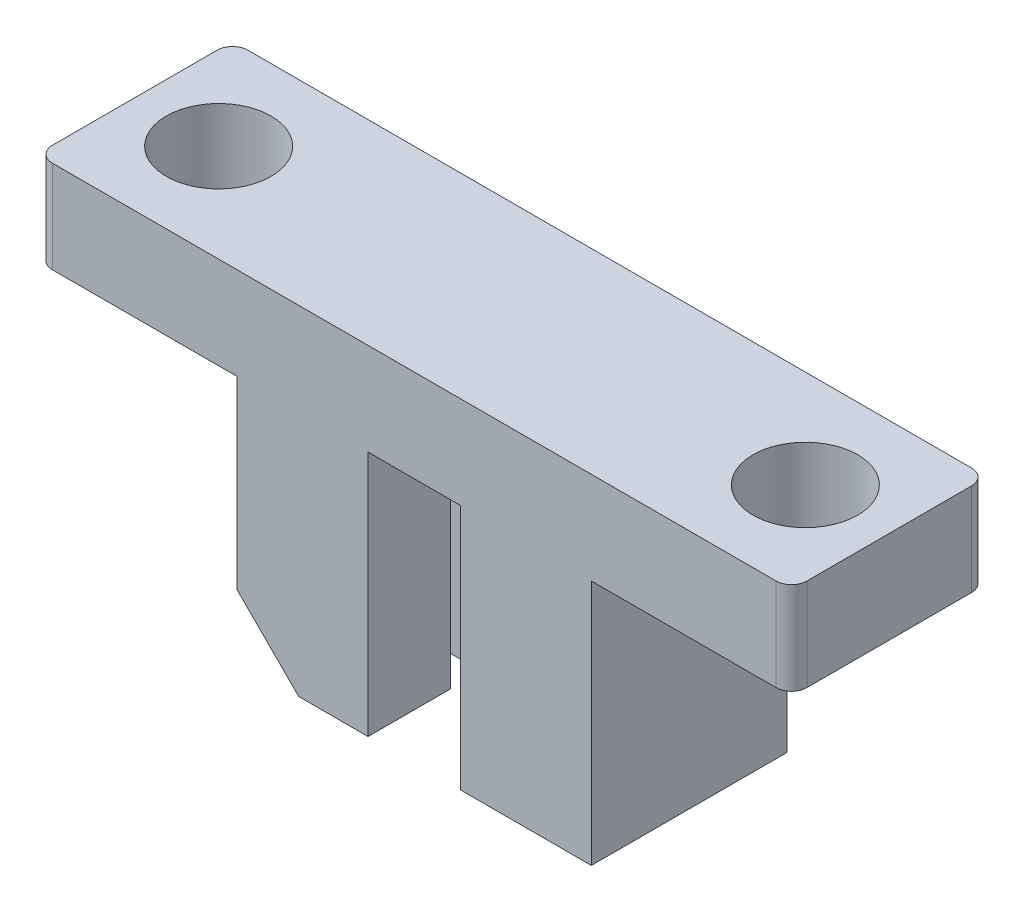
ISO-10303-21;
HEADER;
FILE_DESCRIPTION(('STEP AP214'),'2;1');
FILE_NAME('part.step','',(''),(''),'','','');
FILE_SCHEMA(('AUTOMOTIVE_DESIGN { 1 0 10303 214 1 1 1 1 }'));
ENDSEC;
DATA;
#1=APPLICATION_CONTEXT('core data for automotive mechanical design processes');
#2=APPLICATION_PROTOCOL_DEFINITION('international standard','automotive_design',2000,#1);
#3=PRODUCT_CONTEXT('',#1,'mechanical');
#4=PRODUCT('Part','Part','',(#3));
#5=PRODUCT_RELATED_PRODUCT_CATEGORY('part','',(#4));
#6=PRODUCT_DEFINITION_FORMATION('','',#4);
#7=PRODUCT_DEFINITION_CONTEXT('part definition',#1,'design');
#8=PRODUCT_DEFINITION('design','',#6,#7);
#9=PRODUCT_DEFINITION_SHAPE('','',#8);
#10=(LENGTH_UNIT() NAMED_UNIT(*) SI_UNIT(.MILLI.,.METRE.));
#11=(NAMED_UNIT(*) PLANE_ANGLE_UNIT() SI_UNIT($,.RADIAN.));
#12=(NAMED_UNIT(*) SI_UNIT($,.STERADIAN.) SOLID_ANGLE_UNIT());
#13=UNCERTAINTY_MEASURE_WITH_UNIT(LENGTH_MEASURE(1.E-05),#10,'distance_accuracy_value','');
#14=(GEOMETRIC_REPRESENTATION_CONTEXT(3) GLOBAL_UNCERTAINTY_ASSIGNED_CONTEXT((#13)) GLOBAL_UNIT_ASSIGNED_CONTEXT((#10,
#11,#12)) REPRESENTATION_CONTEXT('',''));
#15=CARTESIAN_POINT('',(0.,0.,0.));
#16=DIRECTION('',(0.,0.,1.));
#17=DIRECTION('',(1.,0.,0.));
#18=AXIS2_PLACEMENT_3D('',#15,#16,#17);
#19=CARTESIAN_POINT('',(-12.25,-3.,3.175));
#20=DIRECTION('',(1.,0.,0.));
#21=DIRECTION('',(0.,1.,0.));
#22=AXIS2_PLACEMENT_3D('',#19,#20,#21);
#23=PLANE('',#22);
#24=DIRECTION('',(0.,0.,-1.));
#25=VECTOR('',#24,1.);
#26=CARTESIAN_POINT('',(-12.25,-3.,3.175));
#27=LINE('',#26,#25);
#28=CARTESIAN_POINT('',(-12.25,-3.,2.675));
#29=VERTEX_POINT('',#28);
#30=CARTESIAN_POINT('',(-12.25,-3.,-2.675));
#31=VERTEX_POINT('',#30);
#32=EDGE_CURVE('E349',#29,#31,#27,.T.);
#33=ORIENTED_EDGE('',*,*,#32,.F.);
#34=DIRECTION('',(0.,-1.,0.));
#35=VECTOR('',#34,1.);
#36=CARTESIAN_POINT('',(-12.25,-3.,2.675));
#37=LINE('',#36,#35);
#38=CARTESIAN_POINT('',(-12.25,0.,2.675));
#39=VERTEX_POINT('',#38);
#40=EDGE_CURVE('E370',#29,#39,#37,.F.);
#41=ORIENTED_EDGE('',*,*,#40,.T.);
#42=DIRECTION('',(0.,0.,-1.));
#43=VECTOR('',#42,1.);
#44=CARTESIAN_POINT('',(-12.25,0.,3.175));
#45=LINE('',#44,#43);
#46=CARTESIAN_POINT('',(-12.25,0.,-2.675));
#47=VERTEX_POINT('',#46);
#48=EDGE_CURVE('E289',#39,#47,#45,.T.);
#49=ORIENTED_EDGE('',*,*,#48,.T.);
#50=DIRECTION('',(0.,-1.,0.));
#51=VECTOR('',#50,1.);
#52=CARTESIAN_POINT('',(-12.25,-3.,-2.675));
#53=LINE('',#52,#51);
#54=EDGE_CURVE('E367',#47,#31,#53,.T.);
#55=ORIENTED_EDGE('',*,*,#54,.T.);
#56=EDGE_LOOP('',(#33,#41,#49,#55));
#57=FACE_BOUND('',#56,.T.);
#58=ADVANCED_FACE('F32',(#57),#23,.F.);
#59=CARTESIAN_POINT('',(-5.75,-3.,3.175));
#60=DIRECTION('',(0.,1.,0.));
#61=DIRECTION('',(-1.,0.,0.));
#62=AXIS2_PLACEMENT_3D('',#59,#60,#61);
#63=PLANE('',#62);
#64=CARTESIAN_POINT('',(-9.525,-3.,0.));
#65=DIRECTION('',(0.,-1.,0.));
#66=DIRECTION('',(0.,0.,-1.));
#67=AXIS2_PLACEMENT_3D('',#64,#65,#66);
#68=CIRCLE('',#67,1.69999999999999);
#69=CARTESIAN_POINT('',(-9.525,-3.,-1.69999999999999));
#70=VERTEX_POINT('',#69);
#71=EDGE_CURVE('E725',#70,#70,#68,.T.);
#72=ORIENTED_EDGE('',*,*,#71,.F.);
#73=EDGE_LOOP('',(#72));
#74=FACE_BOUND('',#73,.T.);
#75=DIRECTION('',(1.,0.,0.));
#76=VECTOR('',#75,1.);
#77=CARTESIAN_POINT('',(-5.75,-3.,3.175));
#78=LINE('',#77,#76);
#79=CARTESIAN_POINT('',(-11.75,-3.,3.175));
#80=VERTEX_POINT('',#79);
#81=CARTESIAN_POINT('',(-5.75,-3.,3.175));
#82=VERTEX_POINT('',#81);
#83=EDGE_CURVE('E264',#80,#82,#78,.T.);
#84=ORIENTED_EDGE('',*,*,#83,.F.);
#85=CARTESIAN_POINT('',(-11.75,-3.,2.675));
#86=DIRECTION('',(0.,1.,0.));
#87=DIRECTION('',(-1.,0.,0.));
#88=AXIS2_PLACEMENT_3D('',#85,#86,#87);
#89=CIRCLE('',#88,0.5);
#90=EDGE_CURVE('E365',#80,#29,#89,.F.);
#91=ORIENTED_EDGE('',*,*,#90,.T.);
#92=ORIENTED_EDGE('',*,*,#32,.T.);
#93=CARTESIAN_POINT('',(-11.75,-3.,-2.675));
#94=DIRECTION('',(0.,1.,0.));
#95=DIRECTION('',(-1.,0.,0.));
#96=AXIS2_PLACEMENT_3D('',#93,#94,#95);
#97=CIRCLE('',#96,0.5);
#98=CARTESIAN_POINT('',(-11.75,-3.,-3.175));
#99=VERTEX_POINT('',#98);
#100=EDGE_CURVE('E363',#31,#99,#97,.F.);
#101=ORIENTED_EDGE('',*,*,#100,.T.);
#102=DIRECTION('',(1.,0.,0.));
#103=VECTOR('',#102,1.);
#104=CARTESIAN_POINT('',(-5.75,-3.,-3.175));
#105=LINE('',#104,#103);
#106=CARTESIAN_POINT('',(-5.75,-3.,-3.175));
#107=VERTEX_POINT('',#106);
#108=EDGE_CURVE('E263',#99,#107,#105,.T.);
#109=ORIENTED_EDGE('',*,*,#108,.T.);
#110=DIRECTION('',(0.,0.,-1.));
#111=VECTOR('',#110,1.);
#112=CARTESIAN_POINT('',(-5.75,-3.,3.175));
#113=LINE('',#112,#111);
#114=EDGE_CURVE('E346',#82,#107,#113,.T.);
#115=ORIENTED_EDGE('',*,*,#114,.F.);
#116=EDGE_LOOP('',(#84,#91,#92,#101,#109,#115));
#117=FACE_BOUND('',#116,.T.);
#118=ADVANCED_FACE('F402',(#74,#117),#63,.F.);
#119=CARTESIAN_POINT('',(-5.75,-9.,3.175));
#120=DIRECTION('',(1.,0.,0.));
#121=DIRECTION('',(0.,0.,-1.));
#122=AXIS2_PLACEMENT_3D('',#119,#120,#121);
#123=PLANE('',#122);
#124=DIRECTION('',(0.,-1.,0.));
#125=VECTOR('',#124,1.);
#126=CARTESIAN_POINT('',(-5.75,-9.,-3.175));
#127=LINE('',#126,#125);
#128=CARTESIAN_POINT('',(-5.75,-9.,-3.175));
#129=VERTEX_POINT('',#128);
#130=EDGE_CURVE('E291',#107,#129,#127,.T.);
#131=ORIENTED_EDGE('',*,*,#130,.T.);
#132=DIRECTION('',(0.,0.,-1.));
#133=VECTOR('',#132,1.);
#134=CARTESIAN_POINT('',(-5.75,-9.,3.175));
#135=LINE('',#134,#133);
#136=CARTESIAN_POINT('',(-5.75,-9.,3.175));
#137=VERTEX_POINT('',#136);
#138=EDGE_CURVE('E343',#137,#129,#135,.T.);
#139=ORIENTED_EDGE('',*,*,#138,.F.);
#140=DIRECTION('',(0.,-1.,0.));
#141=VECTOR('',#140,1.);
#142=CARTESIAN_POINT('',(-5.75,-9.,3.175));
#143=LINE('',#142,#141);
#144=EDGE_CURVE('E266',#82,#137,#143,.T.);
#145=ORIENTED_EDGE('',*,*,#144,.F.);
#146=ORIENTED_EDGE('',*,*,#114,.T.);
#147=EDGE_LOOP('',(#131,#139,#145,#146));
#148=FACE_BOUND('',#147,.T.);
#149=ADVANCED_FACE('F463',(#148),#123,.F.);
#150=CARTESIAN_POINT('',(-3.75,-11.,3.175));
#151=DIRECTION('',(0.707106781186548,0.707106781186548,0.));
#152=DIRECTION('',(-0.707106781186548,0.707106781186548,0.));
#153=AXIS2_PLACEMENT_3D('',#150,#151,#152);
#154=PLANE('',#153);
#155=DIRECTION('',(0.707106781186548,-0.707106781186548,0.));
#156=VECTOR('',#155,1.);
#157=CARTESIAN_POINT('',(-3.75,-11.,-3.175));
#158=LINE('',#157,#156);
#159=CARTESIAN_POINT('',(-3.75,-11.,-3.175));
#160=VERTEX_POINT('',#159);
#161=EDGE_CURVE('E293',#129,#160,#158,.T.);
#162=ORIENTED_EDGE('',*,*,#161,.T.);
#163=DIRECTION('',(0.,0.,-1.));
#164=VECTOR('',#163,1.);
#165=CARTESIAN_POINT('',(-3.75,-11.,3.175));
#166=LINE('',#165,#164);
#167=CARTESIAN_POINT('',(-3.75,-11.,3.175));
#168=VERTEX_POINT('',#167);
#169=EDGE_CURVE('E340',#168,#160,#166,.T.);
#170=ORIENTED_EDGE('',*,*,#169,.F.);
#171=DIRECTION('',(0.707106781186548,-0.707106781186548,0.));
#172=VECTOR('',#171,1.);
#173=CARTESIAN_POINT('',(-3.75,-11.,3.175));
#174=LINE('',#173,#172);
#175=EDGE_CURVE('E269',#137,#168,#174,.T.);
#176=ORIENTED_EDGE('',*,*,#175,.F.);
#177=ORIENTED_EDGE('',*,*,#138,.T.);
#178=EDGE_LOOP('',(#162,#170,#176,#177));
#179=FACE_BOUND('',#178,.T.);
#180=ADVANCED_FACE('F460',(#179),#154,.F.);
#181=CARTESIAN_POINT('',(-1.5,-11.,3.175));
#182=DIRECTION('',(0.,1.,0.));
#183=DIRECTION('',(0.,0.,1.));
#184=AXIS2_PLACEMENT_3D('',#181,#182,#183);
#185=PLANE('',#184);
#186=DIRECTION('',(0.,0.,-1.));
#187=VECTOR('',#186,1.);
#188=CARTESIAN_POINT('',(-2.675,-11.,-0.5));
#189=LINE('',#188,#187);
#190=CARTESIAN_POINT('',(-2.675,-11.,0.5));
#191=VERTEX_POINT('',#190);
#192=CARTESIAN_POINT('',(-2.675,-11.,-0.5));
#193=VERTEX_POINT('',#192);
#194=EDGE_CURVE('E207',#191,#193,#189,.T.);
#195=ORIENTED_EDGE('',*,*,#194,.F.);
#196=DIRECTION('',(-1.,0.,0.));
#197=VECTOR('',#196,1.);
#198=CARTESIAN_POINT('',(2.675,-11.,0.5));
#199=LINE('',#198,#197);
#200=CARTESIAN_POINT('',(-1.5,-11.,0.5));
#201=VERTEX_POINT('',#200);
#202=EDGE_CURVE('E229',#201,#191,#199,.T.);
#203=ORIENTED_EDGE('',*,*,#202,.F.);
#204=DIRECTION('',(0.,0.,-1.));
#205=VECTOR('',#204,1.);
#206=CARTESIAN_POINT('',(-1.5,-11.,3.175));
#207=LINE('',#206,#205);
#208=CARTESIAN_POINT('',(-1.5,-11.,3.175));
#209=VERTEX_POINT('',#208);
#210=EDGE_CURVE('E337',#209,#201,#207,.T.);
#211=ORIENTED_EDGE('',*,*,#210,.F.);
#212=DIRECTION('',(1.,0.,0.));
#213=VECTOR('',#212,1.);
#214=CARTESIAN_POINT('',(-1.5,-11.,3.175));
#215=LINE('',#214,#213);
#216=EDGE_CURVE('E271',#168,#209,#215,.T.);
#217=ORIENTED_EDGE('',*,*,#216,.F.);
#218=ORIENTED_EDGE('',*,*,#169,.T.);
#219=DIRECTION('',(1.,0.,0.));
#220=VECTOR('',#219,1.);
#221=CARTESIAN_POINT('',(-1.5,-11.,-3.175));
#222=LINE('',#221,#220);
#223=CARTESIAN_POINT('',(-1.5,-11.,-3.175));
#224=VERTEX_POINT('',#223);
#225=EDGE_CURVE('E295',#160,#224,#222,.T.);
#226=ORIENTED_EDGE('',*,*,#225,.T.);
#227=CARTESIAN_POINT('',(-1.5,-11.,-0.5));
#228=VERTEX_POINT('',#227);
#229=EDGE_CURVE('E336',#228,#224,#207,.T.);
#230=ORIENTED_EDGE('',*,*,#229,.F.);
#231=DIRECTION('',(1.,0.,0.));
#232=VECTOR('',#231,1.);
#233=CARTESIAN_POINT('',(2.675,-11.,-0.5));
#234=LINE('',#233,#232);
#235=EDGE_CURVE('E240',#193,#228,#234,.T.);
#236=ORIENTED_EDGE('',*,*,#235,.F.);
#237=EDGE_LOOP('',(#195,#203,#211,#217,#218,#226,#230,#236));
#238=FACE_BOUND('',#237,.T.);
#239=ADVANCED_FACE('F454',(#238),#185,.F.);
#240=CARTESIAN_POINT('',(-1.5,-3.,3.175));
#241=DIRECTION('',(-1.,0.,0.));
#242=DIRECTION('',(0.,-1.,0.));
#243=AXIS2_PLACEMENT_3D('',#240,#241,#242);
#244=PLANE('',#243);
#245=ORIENTED_EDGE('',*,*,#210,.T.);
#246=DIRECTION('',(0.,1.,0.));
#247=VECTOR('',#246,1.);
#248=CARTESIAN_POINT('',(-1.5,-3.,0.5));
#249=LINE('',#248,#247);
#250=CARTESIAN_POINT('',(-1.5,-5.5,0.5));
#251=VERTEX_POINT('',#250);
#252=EDGE_CURVE('E258',#201,#251,#249,.T.);
#253=ORIENTED_EDGE('',*,*,#252,.T.);
#254=DIRECTION('',(0.,0.,1.));
#255=VECTOR('',#254,1.);
#256=CARTESIAN_POINT('',(-1.5,-5.5,3.175));
#257=LINE('',#256,#255);
#258=CARTESIAN_POINT('',(-1.5,-5.5,-0.5));
#259=VERTEX_POINT('',#258);
#260=EDGE_CURVE('E261',#259,#251,#257,.T.);
#261=ORIENTED_EDGE('',*,*,#260,.F.);
#262=DIRECTION('',(0.,-1.,0.));
#263=VECTOR('',#262,1.);
#264=CARTESIAN_POINT('',(-1.5,-3.,-0.5));
#265=LINE('',#264,#263);
#266=EDGE_CURVE('E217',#259,#228,#265,.T.);
#267=ORIENTED_EDGE('',*,*,#266,.T.);
#268=ORIENTED_EDGE('',*,*,#229,.T.);
#269=DIRECTION('',(0.,1.,0.));
#270=VECTOR('',#269,1.);
#271=CARTESIAN_POINT('',(-1.5,-3.,-3.175));
#272=LINE('',#271,#270);
#273=CARTESIAN_POINT('',(-1.5,-3.,-3.175));
#274=VERTEX_POINT('',#273);
#275=EDGE_CURVE('E298',#224,#274,#272,.T.);
#276=ORIENTED_EDGE('',*,*,#275,.T.);
#277=DIRECTION('',(0.,0.,-1.));
#278=VECTOR('',#277,1.);
#279=CARTESIAN_POINT('',(-1.5,-3.,3.175));
#280=LINE('',#279,#278);
#281=CARTESIAN_POINT('',(-1.5,-3.,3.175));
#282=VERTEX_POINT('',#281);
#283=EDGE_CURVE('E333',#282,#274,#280,.T.);
#284=ORIENTED_EDGE('',*,*,#283,.F.);
#285=DIRECTION('',(0.,1.,0.));
#286=VECTOR('',#285,1.);
#287=CARTESIAN_POINT('',(-1.5,-3.,3.175));
#288=LINE('',#287,#286);
#289=EDGE_CURVE('E273',#209,#282,#288,.T.);
#290=ORIENTED_EDGE('',*,*,#289,.F.);
#291=EDGE_LOOP('',(#245,#253,#261,#267,#268,#276,#284,#290));
#292=FACE_BOUND('',#291,.T.);
#293=ADVANCED_FACE('F450',(#292),#244,.F.);
#294=CARTESIAN_POINT('',(1.5,-3.,3.175));
#295=DIRECTION('',(0.,1.,0.));
#296=DIRECTION('',(-1.,0.,0.));
#297=AXIS2_PLACEMENT_3D('',#294,#295,#296);
#298=PLANE('',#297);
#299=DIRECTION('',(1.,0.,0.));
#300=VECTOR('',#299,1.);
#301=CARTESIAN_POINT('',(1.5,-3.,-3.175));
#302=LINE('',#301,#300);
#303=CARTESIAN_POINT('',(1.5,-3.,-3.175));
#304=VERTEX_POINT('',#303);
#305=EDGE_CURVE('E300',#274,#304,#302,.T.);
#306=ORIENTED_EDGE('',*,*,#305,.T.);
#307=DIRECTION('',(0.,0.,-1.));
#308=VECTOR('',#307,1.);
#309=CARTESIAN_POINT('',(1.5,-3.,3.175));
#310=LINE('',#309,#308);
#311=CARTESIAN_POINT('',(1.5,-3.,3.175));
#312=VERTEX_POINT('',#311);
#313=EDGE_CURVE('E330',#312,#304,#310,.T.);
#314=ORIENTED_EDGE('',*,*,#313,.F.);
#315=DIRECTION('',(1.,0.,0.));
#316=VECTOR('',#315,1.);
#317=CARTESIAN_POINT('',(1.5,-3.,3.175));
#318=LINE('',#317,#316);
#319=EDGE_CURVE('E275',#282,#312,#318,.T.);
#320=ORIENTED_EDGE('',*,*,#319,.F.);
#321=ORIENTED_EDGE('',*,*,#283,.T.);
#322=EDGE_LOOP('',(#306,#314,#320,#321));
#323=FACE_BOUND('',#322,.T.);
#324=ADVANCED_FACE('F444',(#323),#298,.F.);
#325=CARTESIAN_POINT('',(1.5,-11.,3.175));
#326=DIRECTION('',(1.,0.,0.));
#327=DIRECTION('',(0.,0.,-1.));
#328=AXIS2_PLACEMENT_3D('',#325,#326,#327);
#329=PLANE('',#328);
#330=DIRECTION('',(0.,0.,-1.));
#331=VECTOR('',#330,1.);
#332=CARTESIAN_POINT('',(1.5,-5.5,3.175));
#333=LINE('',#332,#331);
#334=CARTESIAN_POINT('',(1.5,-5.5,0.5));
#335=VERTEX_POINT('',#334);
#336=CARTESIAN_POINT('',(1.5,-5.5,-0.5));
#337=VERTEX_POINT('',#336);
#338=EDGE_CURVE('E355',#335,#337,#333,.T.);
#339=ORIENTED_EDGE('',*,*,#338,.F.);
#340=DIRECTION('',(0.,-1.,0.));
#341=VECTOR('',#340,1.);
#342=CARTESIAN_POINT('',(1.5,-11.,0.5));
#343=LINE('',#342,#341);
#344=CARTESIAN_POINT('',(1.5,-11.,0.5));
#345=VERTEX_POINT('',#344);
#346=EDGE_CURVE('E255',#335,#345,#343,.T.);
#347=ORIENTED_EDGE('',*,*,#346,.T.);
#348=DIRECTION('',(0.,0.,-1.));
#349=VECTOR('',#348,1.);
#350=CARTESIAN_POINT('',(1.5,-11.,3.175));
#351=LINE('',#350,#349);
#352=CARTESIAN_POINT('',(1.5,-11.,3.175));
#353=VERTEX_POINT('',#352);
#354=EDGE_CURVE('E327',#353,#345,#351,.T.);
#355=ORIENTED_EDGE('',*,*,#354,.F.);
#356=DIRECTION('',(0.,-1.,0.));
#357=VECTOR('',#356,1.);
#358=CARTESIAN_POINT('',(1.5,-11.,3.175));
#359=LINE('',#358,#357);
#360=EDGE_CURVE('E277',#312,#353,#359,.T.);
#361=ORIENTED_EDGE('',*,*,#360,.F.);
#362=ORIENTED_EDGE('',*,*,#313,.T.);
#363=DIRECTION('',(0.,-1.,0.));
#364=VECTOR('',#363,1.);
#365=CARTESIAN_POINT('',(1.5,-11.,-3.175));
#366=LINE('',#365,#364);
#367=CARTESIAN_POINT('',(1.5,-11.,-3.175));
#368=VERTEX_POINT('',#367);
#369=EDGE_CURVE('E302',#304,#368,#366,.T.);
#370=ORIENTED_EDGE('',*,*,#369,.T.);
#371=CARTESIAN_POINT('',(1.5,-11.,-0.5));
#372=VERTEX_POINT('',#371);
#373=EDGE_CURVE('E326',#372,#368,#351,.T.);
#374=ORIENTED_EDGE('',*,*,#373,.F.);
#375=DIRECTION('',(0.,1.,0.));
#376=VECTOR('',#375,1.);
#377=CARTESIAN_POINT('',(1.5,-11.,-0.5));
#378=LINE('',#377,#376);
#379=EDGE_CURVE('E247',#372,#337,#378,.T.);
#380=ORIENTED_EDGE('',*,*,#379,.T.);
#381=EDGE_LOOP('',(#339,#347,#355,#361,#362,#370,#374,#380));
#382=FACE_BOUND('',#381,.T.);
#383=ADVANCED_FACE('F438',(#382),#329,.F.);
#384=CARTESIAN_POINT('',(5.75,-11.,3.175));
#385=DIRECTION('',(0.,1.,0.));
#386=DIRECTION('',(-1.,0.,0.));
#387=AXIS2_PLACEMENT_3D('',#384,#385,#386);
#388=PLANE('',#387);
#389=ORIENTED_EDGE('',*,*,#354,.T.);
#390=CARTESIAN_POINT('',(2.675,-11.,0.5));
#391=VERTEX_POINT('',#390);
#392=EDGE_CURVE('E227',#391,#345,#199,.T.);
#393=ORIENTED_EDGE('',*,*,#392,.F.);
#394=DIRECTION('',(0.,0.,1.));
#395=VECTOR('',#394,1.);
#396=CARTESIAN_POINT('',(2.675,-11.,-0.5));
#397=LINE('',#396,#395);
#398=CARTESIAN_POINT('',(2.675,-11.,-0.5));
#399=VERTEX_POINT('',#398);
#400=EDGE_CURVE('E242',#399,#391,#397,.T.);
#401=ORIENTED_EDGE('',*,*,#400,.F.);
#402=DIRECTION('',(-1.,0.,0.));
#403=VECTOR('',#402,1.);
#404=CARTESIAN_POINT('',(5.75,-11.,-0.499999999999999));
#405=LINE('',#404,#403);
#406=EDGE_CURVE('E352',#399,#372,#405,.T.);
#407=ORIENTED_EDGE('',*,*,#406,.T.);
#408=ORIENTED_EDGE('',*,*,#373,.T.);
#409=DIRECTION('',(1.,0.,0.));
#410=VECTOR('',#409,1.);
#411=CARTESIAN_POINT('',(5.75,-11.,-3.175));
#412=LINE('',#411,#410);
#413=CARTESIAN_POINT('',(5.75,-11.,-3.175));
#414=VERTEX_POINT('',#413);
#415=EDGE_CURVE('E305',#368,#414,#412,.T.);
#416=ORIENTED_EDGE('',*,*,#415,.T.);
#417=DIRECTION('',(0.,0.,-1.));
#418=VECTOR('',#417,1.);
#419=CARTESIAN_POINT('',(5.75,-11.,3.175));
#420=LINE('',#419,#418);
#421=CARTESIAN_POINT('',(5.75,-11.,3.175));
#422=VERTEX_POINT('',#421);
#423=EDGE_CURVE('E323',#422,#414,#420,.T.);
#424=ORIENTED_EDGE('',*,*,#423,.F.);
#425=DIRECTION('',(1.,0.,0.));
#426=VECTOR('',#425,1.);
#427=CARTESIAN_POINT('',(5.75,-11.,3.175));
#428=LINE('',#427,#426);
#429=EDGE_CURVE('E279',#353,#422,#428,.T.);
#430=ORIENTED_EDGE('',*,*,#429,.F.);
#431=EDGE_LOOP('',(#389,#393,#401,#407,#408,#416,#424,#430));
#432=FACE_BOUND('',#431,.T.);
#433=ADVANCED_FACE('F433',(#432),#388,.F.);
#434=CARTESIAN_POINT('',(5.75,-3.,3.175));
#435=DIRECTION('',(-1.,0.,0.));
#436=DIRECTION('',(0.,-1.,0.));
#437=AXIS2_PLACEMENT_3D('',#434,#435,#436);
#438=PLANE('',#437);
#439=DIRECTION('',(0.,1.,0.));
#440=VECTOR('',#439,1.);
#441=CARTESIAN_POINT('',(5.75,-3.,-3.175));
#442=LINE('',#441,#440);
#443=CARTESIAN_POINT('',(5.75,-3.,-3.175));
#444=VERTEX_POINT('',#443);
#445=EDGE_CURVE('E307',#414,#444,#442,.T.);
#446=ORIENTED_EDGE('',*,*,#445,.T.);
#447=DIRECTION('',(0.,0.,-1.));
#448=VECTOR('',#447,1.);
#449=CARTESIAN_POINT('',(5.75,-3.,3.175));
#450=LINE('',#449,#448);
#451=CARTESIAN_POINT('',(5.75,-3.,3.175));
#452=VERTEX_POINT('',#451);
#453=EDGE_CURVE('E320',#452,#444,#450,.T.);
#454=ORIENTED_EDGE('',*,*,#453,.F.);
#455=DIRECTION('',(0.,1.,0.));
#456=VECTOR('',#455,1.);
#457=CARTESIAN_POINT('',(5.75,-3.,3.175));
#458=LINE('',#457,#456);
#459=EDGE_CURVE('E281',#422,#452,#458,.T.);
#460=ORIENTED_EDGE('',*,*,#459,.F.);
#461=ORIENTED_EDGE('',*,*,#423,.T.);
#462=EDGE_LOOP('',(#446,#454,#460,#461));
#463=FACE_BOUND('',#462,.T.);
#464=ADVANCED_FACE('F427',(#463),#438,.F.);
#465=CARTESIAN_POINT('',(12.25,-3.,3.175));
#466=DIRECTION('',(0.,1.,0.));
#467=DIRECTION('',(-1.,0.,0.));
#468=AXIS2_PLACEMENT_3D('',#465,#466,#467);
#469=PLANE('',#468);
#470=CARTESIAN_POINT('',(9.525,-3.,0.));
#471=DIRECTION('',(0.,-1.,0.));
#472=DIRECTION('',(0.,0.,-1.));
#473=AXIS2_PLACEMENT_3D('',#470,#471,#472);
#474=CIRCLE('',#473,1.69999999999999);
#475=CARTESIAN_POINT('',(9.525,-3.,-1.69999999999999));
#476=VERTEX_POINT('',#475);
#477=EDGE_CURVE('E722',#476,#476,#474,.T.);
#478=ORIENTED_EDGE('',*,*,#477,.F.);
#479=EDGE_LOOP('',(#478));
#480=FACE_BOUND('',#479,.T.);
#481=DIRECTION('',(0.,0.,-1.));
#482=VECTOR('',#481,1.);
#483=CARTESIAN_POINT('',(12.25,-3.,3.175));
#484=LINE('',#483,#482);
#485=CARTESIAN_POINT('',(12.25,-3.,2.675));
#486=VERTEX_POINT('',#485);
#487=CARTESIAN_POINT('',(12.25,-3.,-2.675));
#488=VERTEX_POINT('',#487);
#489=EDGE_CURVE('E318',#486,#488,#484,.T.);
#490=ORIENTED_EDGE('',*,*,#489,.F.);
#491=CARTESIAN_POINT('',(11.75,-3.,2.675));
#492=DIRECTION('',(0.,1.,0.));
#493=DIRECTION('',(-1.,0.,0.));
#494=AXIS2_PLACEMENT_3D('',#491,#492,#493);
#495=CIRCLE('',#494,0.5);
#496=CARTESIAN_POINT('',(11.75,-3.,3.175));
#497=VERTEX_POINT('',#496);
#498=EDGE_CURVE('E386',#486,#497,#495,.F.);
#499=ORIENTED_EDGE('',*,*,#498,.T.);
#500=DIRECTION('',(1.,0.,0.));
#501=VECTOR('',#500,1.);
#502=CARTESIAN_POINT('',(12.25,-3.,3.175));
#503=LINE('',#502,#501);
#504=EDGE_CURVE('E283',#452,#497,#503,.T.);
#505=ORIENTED_EDGE('',*,*,#504,.F.);
#506=ORIENTED_EDGE('',*,*,#453,.T.);
#507=DIRECTION('',(1.,0.,0.));
#508=VECTOR('',#507,1.);
#509=CARTESIAN_POINT('',(12.25,-3.,-3.175));
#510=LINE('',#509,#508);
#511=CARTESIAN_POINT('',(11.75,-3.,-3.175));
#512=VERTEX_POINT('',#511);
#513=EDGE_CURVE('E309',#444,#512,#510,.T.);
#514=ORIENTED_EDGE('',*,*,#513,.T.);
#515=CARTESIAN_POINT('',(11.75,-3.,-2.675));
#516=DIRECTION('',(0.,1.,0.));
#517=DIRECTION('',(-1.,0.,0.));
#518=AXIS2_PLACEMENT_3D('',#515,#516,#517);
#519=CIRCLE('',#518,0.5);
#520=EDGE_CURVE('E52',#512,#488,#519,.F.);
#521=ORIENTED_EDGE('',*,*,#520,.T.);
#522=EDGE_LOOP('',(#490,#499,#505,#506,#514,#521));
#523=FACE_BOUND('',#522,.T.);
#524=ADVANCED_FACE('F421',(#480,#523),#469,.F.);
#525=CARTESIAN_POINT('',(12.25,0.,3.175));
#526=DIRECTION('',(-1.,0.,0.));
#527=DIRECTION('',(0.,-1.,0.));
#528=AXIS2_PLACEMENT_3D('',#525,#526,#527);
#529=PLANE('',#528);
#530=DIRECTION('',(0.,0.,-1.));
#531=VECTOR('',#530,1.);
#532=CARTESIAN_POINT('',(12.25,0.,3.175));
#533=LINE('',#532,#531);
#534=CARTESIAN_POINT('',(12.25,0.,2.675));
#535=VERTEX_POINT('',#534);
#536=CARTESIAN_POINT('',(12.25,0.,-2.675));
#537=VERTEX_POINT('',#536);
#538=EDGE_CURVE('E315',#535,#537,#533,.T.);
#539=ORIENTED_EDGE('',*,*,#538,.F.);
#540=DIRECTION('',(0.,1.,0.));
#541=VECTOR('',#540,1.);
#542=CARTESIAN_POINT('',(12.25,0.,2.675));
#543=LINE('',#542,#541);
#544=EDGE_CURVE('E383',#535,#486,#543,.F.);
#545=ORIENTED_EDGE('',*,*,#544,.T.);
#546=ORIENTED_EDGE('',*,*,#489,.T.);
#547=DIRECTION('',(0.,1.,0.));
#548=VECTOR('',#547,1.);
#549=CARTESIAN_POINT('',(12.25,0.,-2.675));
#550=LINE('',#549,#548);
#551=EDGE_CURVE('E380',#488,#537,#550,.T.);
#552=ORIENTED_EDGE('',*,*,#551,.T.);
#553=EDGE_LOOP('',(#539,#545,#546,#552));
#554=FACE_BOUND('',#553,.T.);
#555=ADVANCED_FACE('F416',(#554),#529,.F.);
#556=CARTESIAN_POINT('',(-12.25,0.,3.175));
#557=DIRECTION('',(0.,-1.,0.));
#558=DIRECTION('',(1.,0.,0.));
#559=AXIS2_PLACEMENT_3D('',#556,#557,#558);
#560=PLANE('',#559);
#561=CARTESIAN_POINT('',(-9.525,0.,0.));
#562=DIRECTION('',(0.,-1.,0.));
#563=DIRECTION('',(0.,0.,-1.));
#564=AXIS2_PLACEMENT_3D('',#561,#562,#563);
#565=CIRCLE('',#564,1.69999999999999);
#566=CARTESIAN_POINT('',(-9.525,0.,-1.69999999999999));
#567=VERTEX_POINT('',#566);
#568=EDGE_CURVE('E723',#567,#567,#565,.T.);
#569=ORIENTED_EDGE('',*,*,#568,.T.);
#570=EDGE_LOOP('',(#569));
#571=FACE_BOUND('',#570,.T.);
#572=CARTESIAN_POINT('',(9.525,0.,0.));
#573=DIRECTION('',(0.,-1.,0.));
#574=DIRECTION('',(0.,0.,-1.));
#575=AXIS2_PLACEMENT_3D('',#572,#573,#574);
#576=CIRCLE('',#575,1.69999999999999);
#577=CARTESIAN_POINT('',(9.525,0.,-1.69999999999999));
#578=VERTEX_POINT('',#577);
#579=EDGE_CURVE('E232',#578,#578,#576,.T.);
#580=ORIENTED_EDGE('',*,*,#579,.T.);
#581=EDGE_LOOP('',(#580));
#582=FACE_BOUND('',#581,.T.);
#583=ORIENTED_EDGE('',*,*,#48,.F.);
#584=CARTESIAN_POINT('',(-11.75,0.,2.675));
#585=DIRECTION('',(0.,-1.,0.));
#586=DIRECTION('',(1.,0.,0.));
#587=AXIS2_PLACEMENT_3D('',#584,#585,#586);
#588=CIRCLE('',#587,0.5);
#589=CARTESIAN_POINT('',(-11.75,0.,3.175));
#590=VERTEX_POINT('',#589);
#591=EDGE_CURVE('E378',#39,#590,#588,.F.);
#592=ORIENTED_EDGE('',*,*,#591,.T.);
#593=DIRECTION('',(-1.,0.,0.));
#594=VECTOR('',#593,1.);
#595=CARTESIAN_POINT('',(-12.25,0.,3.175));
#596=LINE('',#595,#594);
#597=CARTESIAN_POINT('',(11.75,0.,3.175));
#598=VERTEX_POINT('',#597);
#599=EDGE_CURVE('E286',#598,#590,#596,.T.);
#600=ORIENTED_EDGE('',*,*,#599,.F.);
#601=CARTESIAN_POINT('',(11.75,0.,2.675));
#602=DIRECTION('',(0.,-1.,0.));
#603=DIRECTION('',(1.,0.,0.));
#604=AXIS2_PLACEMENT_3D('',#601,#602,#603);
#605=CIRCLE('',#604,0.5);
#606=EDGE_CURVE('E376',#598,#535,#605,.F.);
#607=ORIENTED_EDGE('',*,*,#606,.T.);
#608=ORIENTED_EDGE('',*,*,#538,.T.);
#609=CARTESIAN_POINT('',(11.75,0.,-2.675));
#610=DIRECTION('',(0.,-1.,0.));
#611=DIRECTION('',(1.,0.,0.));
#612=AXIS2_PLACEMENT_3D('',#609,#610,#611);
#613=CIRCLE('',#612,0.5);
#614=CARTESIAN_POINT('',(11.75,0.,-3.175));
#615=VERTEX_POINT('',#614);
#616=EDGE_CURVE('E374',#537,#615,#613,.F.);
#617=ORIENTED_EDGE('',*,*,#616,.T.);
#618=DIRECTION('',(-1.,0.,0.));
#619=VECTOR('',#618,1.);
#620=CARTESIAN_POINT('',(-12.25,0.,-3.175));
#621=LINE('',#620,#619);
#622=CARTESIAN_POINT('',(-11.75,0.,-3.175));
#623=VERTEX_POINT('',#622);
#624=EDGE_CURVE('E267',#615,#623,#621,.T.);
#625=ORIENTED_EDGE('',*,*,#624,.T.);
#626=CARTESIAN_POINT('',(-11.75,0.,-2.675));
#627=DIRECTION('',(0.,-1.,0.));
#628=DIRECTION('',(1.,0.,0.));
#629=AXIS2_PLACEMENT_3D('',#626,#627,#628);
#630=CIRCLE('',#629,0.5);
#631=EDGE_CURVE('E372',#623,#47,#630,.F.);
#632=ORIENTED_EDGE('',*,*,#631,.T.);
#633=EDGE_LOOP('',(#583,#592,#600,#607,#608,#617,#625,#632));
#634=FACE_BOUND('',#633,.T.);
#635=ADVANCED_FACE('F395',(#571,#582,#634),#560,.F.);
#636=CARTESIAN_POINT('',(0.,0.,3.175));
#637=DIRECTION('',(0.,0.,-1.));
#638=DIRECTION('',(-1.,0.,0.));
#639=AXIS2_PLACEMENT_3D('',#636,#637,#638);
#640=PLANE('',#639);
#641=ORIENTED_EDGE('',*,*,#599,.T.);
#642=DIRECTION('',(0.,-1.,0.));
#643=VECTOR('',#642,1.);
#644=CARTESIAN_POINT('',(-11.75,0.,3.175));
#645=LINE('',#644,#643);
#646=EDGE_CURVE('E360',#590,#80,#645,.T.);
#647=ORIENTED_EDGE('',*,*,#646,.T.);
#648=ORIENTED_EDGE('',*,*,#83,.T.);
#649=ORIENTED_EDGE('',*,*,#144,.T.);
#650=ORIENTED_EDGE('',*,*,#175,.T.);
#651=ORIENTED_EDGE('',*,*,#216,.T.);
#652=ORIENTED_EDGE('',*,*,#289,.T.);
#653=ORIENTED_EDGE('',*,*,#319,.T.);
#654=ORIENTED_EDGE('',*,*,#360,.T.);
#655=ORIENTED_EDGE('',*,*,#429,.T.);
#656=ORIENTED_EDGE('',*,*,#459,.T.);
#657=ORIENTED_EDGE('',*,*,#504,.T.);
#658=DIRECTION('',(0.,1.,0.));
#659=VECTOR('',#658,1.);
#660=CARTESIAN_POINT('',(11.75,0.,3.175));
#661=LINE('',#660,#659);
#662=EDGE_CURVE('E357',#497,#598,#661,.T.);
#663=ORIENTED_EDGE('',*,*,#662,.T.);
#664=EDGE_LOOP('',(#641,#647,#648,#649,#650,#651,#652,#653,#654,#655,#656,#657,#663));
#665=FACE_BOUND('',#664,.T.);
#666=ADVANCED_FACE('F409',(#665),#640,.F.);
#667=CARTESIAN_POINT('',(0.,0.,-3.175));
#668=DIRECTION('',(0.,0.,-1.));
#669=DIRECTION('',(-1.,0.,0.));
#670=AXIS2_PLACEMENT_3D('',#667,#668,#669);
#671=PLANE('',#670);
#672=ORIENTED_EDGE('',*,*,#624,.F.);
#673=DIRECTION('',(0.,1.,0.));
#674=VECTOR('',#673,1.);
#675=CARTESIAN_POINT('',(11.75,-3.,-3.175));
#676=LINE('',#675,#674);
#677=EDGE_CURVE('E11',#615,#512,#676,.F.);
#678=ORIENTED_EDGE('',*,*,#677,.T.);
#679=ORIENTED_EDGE('',*,*,#513,.F.);
#680=ORIENTED_EDGE('',*,*,#445,.F.);
#681=ORIENTED_EDGE('',*,*,#415,.F.);
#682=ORIENTED_EDGE('',*,*,#369,.F.);
#683=ORIENTED_EDGE('',*,*,#305,.F.);
#684=ORIENTED_EDGE('',*,*,#275,.F.);
#685=ORIENTED_EDGE('',*,*,#225,.F.);
#686=ORIENTED_EDGE('',*,*,#161,.F.);
#687=ORIENTED_EDGE('',*,*,#130,.F.);
#688=ORIENTED_EDGE('',*,*,#108,.F.);
#689=DIRECTION('',(0.,-1.,0.));
#690=VECTOR('',#689,1.);
#691=CARTESIAN_POINT('',(-11.75,0.,-3.175));
#692=LINE('',#691,#690);
#693=EDGE_CURVE('E40',#99,#623,#692,.F.);
#694=ORIENTED_EDGE('',*,*,#693,.T.);
#695=EDGE_LOOP('',(#672,#678,#679,#680,#681,#682,#683,#684,#685,#686,#687,#688,#694));
#696=FACE_BOUND('',#695,.T.);
#697=ADVANCED_FACE('F389',(#696),#671,.T.);
#698=CARTESIAN_POINT('',(2.675,-5.5,-0.5));
#699=DIRECTION('',(0.,0.,-1.));
#700=DIRECTION('',(-1.,0.,0.));
#701=AXIS2_PLACEMENT_3D('',#698,#699,#700);
#702=PLANE('',#701);
#703=ORIENTED_EDGE('',*,*,#406,.F.);
#704=DIRECTION('',(0.,-1.,0.));
#705=VECTOR('',#704,1.);
#706=CARTESIAN_POINT('',(2.675,-5.5,-0.5));
#707=LINE('',#706,#705);
#708=CARTESIAN_POINT('',(2.675,-5.5,-0.5));
#709=VERTEX_POINT('',#708);
#710=EDGE_CURVE('E210',#709,#399,#707,.T.);
#711=ORIENTED_EDGE('',*,*,#710,.F.);
#712=DIRECTION('',(1.,0.,0.));
#713=VECTOR('',#712,1.);
#714=CARTESIAN_POINT('',(2.675,-5.5,-0.5));
#715=LINE('',#714,#713);
#716=EDGE_CURVE('E221',#337,#709,#715,.T.);
#717=ORIENTED_EDGE('',*,*,#716,.F.);
#718=ORIENTED_EDGE('',*,*,#379,.F.);
#719=EDGE_LOOP('',(#703,#711,#717,#718));
#720=FACE_BOUND('',#719,.T.);
#721=ADVANCED_FACE('F476',(#720),#702,.F.);
#722=CARTESIAN_POINT('',(2.675,-5.5,-0.5));
#723=DIRECTION('',(1.,0.,0.));
#724=DIRECTION('',(0.,0.,-1.));
#725=AXIS2_PLACEMENT_3D('',#722,#723,#724);
#726=PLANE('',#725);
#727=ORIENTED_EDGE('',*,*,#400,.T.);
#728=DIRECTION('',(0.,-1.,0.));
#729=VECTOR('',#728,1.);
#730=CARTESIAN_POINT('',(2.675,-5.5,0.5));
#731=LINE('',#730,#729);
#732=CARTESIAN_POINT('',(2.675,-5.5,0.5));
#733=VERTEX_POINT('',#732);
#734=EDGE_CURVE('E248',#733,#391,#731,.T.);
#735=ORIENTED_EDGE('',*,*,#734,.F.);
#736=DIRECTION('',(0.,0.,1.));
#737=VECTOR('',#736,1.);
#738=CARTESIAN_POINT('',(2.675,-5.5,-0.5));
#739=LINE('',#738,#737);
#740=EDGE_CURVE('E220',#709,#733,#739,.T.);
#741=ORIENTED_EDGE('',*,*,#740,.F.);
#742=ORIENTED_EDGE('',*,*,#710,.T.);
#743=EDGE_LOOP('',(#727,#735,#741,#742));
#744=FACE_BOUND('',#743,.T.);
#745=ADVANCED_FACE('F481',(#744),#726,.F.);
#746=CARTESIAN_POINT('',(2.675,-5.5,0.5));
#747=DIRECTION('',(0.,0.,1.));
#748=DIRECTION('',(1.,0.,0.));
#749=AXIS2_PLACEMENT_3D('',#746,#747,#748);
#750=PLANE('',#749);
#751=DIRECTION('',(-1.,0.,0.));
#752=VECTOR('',#751,1.);
#753=CARTESIAN_POINT('',(2.675,-5.5,0.5));
#754=LINE('',#753,#752);
#755=EDGE_CURVE('E211',#733,#335,#754,.T.);
#756=ORIENTED_EDGE('',*,*,#755,.F.);
#757=ORIENTED_EDGE('',*,*,#734,.T.);
#758=ORIENTED_EDGE('',*,*,#392,.T.);
#759=ORIENTED_EDGE('',*,*,#346,.F.);
#760=EDGE_LOOP('',(#756,#757,#758,#759));
#761=FACE_BOUND('',#760,.T.);
#762=ADVANCED_FACE('F470',(#761),#750,.F.);
#763=CARTESIAN_POINT('',(0.,-5.5,0.));
#764=DIRECTION('',(0.,-1.,0.));
#765=DIRECTION('',(0.,0.,-1.));
#766=AXIS2_PLACEMENT_3D('',#763,#764,#765);
#767=PLANE('',#766);
#768=ORIENTED_EDGE('',*,*,#338,.T.);
#769=ORIENTED_EDGE('',*,*,#716,.T.);
#770=ORIENTED_EDGE('',*,*,#740,.T.);
#771=ORIENTED_EDGE('',*,*,#755,.T.);
#772=EDGE_LOOP('',(#768,#769,#770,#771));
#773=FACE_BOUND('',#772,.T.);
#774=ADVANCED_FACE('F477',(#773),#767,.T.);
#775=ORIENTED_EDGE('',*,*,#260,.T.);
#776=CARTESIAN_POINT('',(-2.675,-5.5,0.5));
#777=VERTEX_POINT('',#776);
#778=EDGE_CURVE('E225',#251,#777,#754,.T.);
#779=ORIENTED_EDGE('',*,*,#778,.T.);
#780=DIRECTION('',(0.,0.,-1.));
#781=VECTOR('',#780,1.);
#782=CARTESIAN_POINT('',(-2.675,-5.5,-0.5));
#783=LINE('',#782,#781);
#784=CARTESIAN_POINT('',(-2.675,-5.5,-0.5));
#785=VERTEX_POINT('',#784);
#786=EDGE_CURVE('E205',#777,#785,#783,.T.);
#787=ORIENTED_EDGE('',*,*,#786,.T.);
#788=EDGE_CURVE('E214',#785,#259,#715,.T.);
#789=ORIENTED_EDGE('',*,*,#788,.T.);
#790=EDGE_LOOP('',(#775,#779,#787,#789));
#791=FACE_BOUND('',#790,.T.);
#792=ADVANCED_FACE('F223',(#791),#767,.T.);
#793=ORIENTED_EDGE('',*,*,#202,.T.);
#794=DIRECTION('',(0.,-1.,0.));
#795=VECTOR('',#794,1.);
#796=CARTESIAN_POINT('',(-2.675,-5.5,0.5));
#797=LINE('',#796,#795);
#798=EDGE_CURVE('E245',#777,#191,#797,.T.);
#799=ORIENTED_EDGE('',*,*,#798,.F.);
#800=ORIENTED_EDGE('',*,*,#778,.F.);
#801=ORIENTED_EDGE('',*,*,#252,.F.);
#802=EDGE_LOOP('',(#793,#799,#800,#801));
#803=FACE_BOUND('',#802,.T.);
#804=ADVANCED_FACE('F467',(#803),#750,.F.);
#805=ORIENTED_EDGE('',*,*,#788,.F.);
#806=DIRECTION('',(0.,-1.,0.));
#807=VECTOR('',#806,1.);
#808=CARTESIAN_POINT('',(-2.675,-5.5,-0.5));
#809=LINE('',#808,#807);
#810=EDGE_CURVE('E200',#785,#193,#809,.T.);
#811=ORIENTED_EDGE('',*,*,#810,.T.);
#812=ORIENTED_EDGE('',*,*,#235,.T.);
#813=ORIENTED_EDGE('',*,*,#266,.F.);
#814=EDGE_LOOP('',(#805,#811,#812,#813));
#815=FACE_BOUND('',#814,.T.);
#816=ADVANCED_FACE('F215',(#815),#702,.F.);
#817=CARTESIAN_POINT('',(-2.675,-5.5,-0.5));
#818=DIRECTION('',(-1.,0.,0.));
#819=DIRECTION('',(0.,0.,1.));
#820=AXIS2_PLACEMENT_3D('',#817,#818,#819);
#821=PLANE('',#820);
#822=ORIENTED_EDGE('',*,*,#194,.T.);
#823=ORIENTED_EDGE('',*,*,#810,.F.);
#824=ORIENTED_EDGE('',*,*,#786,.F.);
#825=ORIENTED_EDGE('',*,*,#798,.T.);
#826=EDGE_LOOP('',(#822,#823,#824,#825));
#827=FACE_BOUND('',#826,.T.);
#828=ADVANCED_FACE('F202',(#827),#821,.F.);
#829=CARTESIAN_POINT('',(9.525,-3.,0.));
#830=DIRECTION('',(0.,-1.,0.));
#831=DIRECTION('',(0.,0.,-1.));
#832=AXIS2_PLACEMENT_3D('',#829,#830,#831);
#833=CYLINDRICAL_SURFACE('',#832,1.69999999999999);
#834=ORIENTED_EDGE('',*,*,#579,.F.);
#835=EDGE_LOOP('',(#834));
#836=FACE_BOUND('',#835,.T.);
#837=ORIENTED_EDGE('',*,*,#477,.T.);
#838=EDGE_LOOP('',(#837));
#839=FACE_BOUND('',#838,.T.);
#840=ADVANCED_FACE('F587',(#836,#839),#833,.F.);
#841=CARTESIAN_POINT('',(-9.525,-3.,0.));
#842=DIRECTION('',(0.,-1.,0.));
#843=DIRECTION('',(0.,0.,-1.));
#844=AXIS2_PLACEMENT_3D('',#841,#842,#843);
#845=CYLINDRICAL_SURFACE('',#844,1.69999999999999);
#846=ORIENTED_EDGE('',*,*,#568,.F.);
#847=EDGE_LOOP('',(#846));
#848=FACE_BOUND('',#847,.T.);
#849=ORIENTED_EDGE('',*,*,#71,.T.);
#850=EDGE_LOOP('',(#849));
#851=FACE_BOUND('',#850,.T.);
#852=ADVANCED_FACE('F494',(#848,#851),#845,.F.);
#853=CARTESIAN_POINT('',(-11.75,0.,2.675));
#854=DIRECTION('',(0.,-1.,0.));
#855=DIRECTION('',(1.,0.,0.));
#856=AXIS2_PLACEMENT_3D('',#853,#854,#855);
#857=CYLINDRICAL_SURFACE('',#856,0.5);
#858=ORIENTED_EDGE('',*,*,#591,.F.);
#859=ORIENTED_EDGE('',*,*,#40,.F.);
#860=ORIENTED_EDGE('',*,*,#90,.F.);
#861=ORIENTED_EDGE('',*,*,#646,.F.);
#862=EDGE_LOOP('',(#858,#859,#860,#861));
#863=FACE_BOUND('',#862,.T.);
#864=ADVANCED_FACE('F407',(#863),#857,.T.);
#865=CARTESIAN_POINT('',(11.75,0.,2.675));
#866=DIRECTION('',(0.,1.,0.));
#867=DIRECTION('',(-1.,0.,0.));
#868=AXIS2_PLACEMENT_3D('',#865,#866,#867);
#869=CYLINDRICAL_SURFACE('',#868,0.5);
#870=ORIENTED_EDGE('',*,*,#498,.F.);
#871=ORIENTED_EDGE('',*,*,#544,.F.);
#872=ORIENTED_EDGE('',*,*,#606,.F.);
#873=ORIENTED_EDGE('',*,*,#662,.F.);
#874=EDGE_LOOP('',(#870,#871,#872,#873));
#875=FACE_BOUND('',#874,.T.);
#876=ADVANCED_FACE('F419',(#875),#869,.T.);
#877=CARTESIAN_POINT('',(11.75,0.,-2.675));
#878=DIRECTION('',(0.,-1.,0.));
#879=DIRECTION('',(1.,0.,0.));
#880=AXIS2_PLACEMENT_3D('',#877,#878,#879);
#881=CYLINDRICAL_SURFACE('',#880,0.5);
#882=ORIENTED_EDGE('',*,*,#520,.F.);
#883=ORIENTED_EDGE('',*,*,#677,.F.);
#884=ORIENTED_EDGE('',*,*,#616,.F.);
#885=ORIENTED_EDGE('',*,*,#551,.F.);
#886=EDGE_LOOP('',(#882,#883,#884,#885));
#887=FACE_BOUND('',#886,.T.);
#888=ADVANCED_FACE('F496',(#887),#881,.T.);
#889=CARTESIAN_POINT('',(-11.75,-3.,-2.675));
#890=DIRECTION('',(0.,1.,0.));
#891=DIRECTION('',(-1.,0.,0.));
#892=AXIS2_PLACEMENT_3D('',#889,#890,#891);
#893=CYLINDRICAL_SURFACE('',#892,0.5);
#894=ORIENTED_EDGE('',*,*,#631,.F.);
#895=ORIENTED_EDGE('',*,*,#693,.F.);
#896=ORIENTED_EDGE('',*,*,#100,.F.);
#897=ORIENTED_EDGE('',*,*,#54,.F.);
#898=EDGE_LOOP('',(#894,#895,#896,#897));
#899=FACE_BOUND('',#898,.T.);
#900=ADVANCED_FACE('F34',(#899),#893,.T.);
#901=CLOSED_SHELL('',(#58,#118,#149,#180,#239,#293,#324,#383,#433,#464,#524,#555,#635,#666,#697,
#721,#745,#762,#774,#792,#804,#816,#828,#840,#852,#864,#876,#888,#900));
#902=MANIFOLD_SOLID_BREP('B2',#901);
#903=ADVANCED_BREP_SHAPE_REPRESENTATION('',(#18,#902),#14);
#904=SHAPE_DEFINITION_REPRESENTATION(#9,#903);
ENDSEC;
END-ISO-10303-21;
